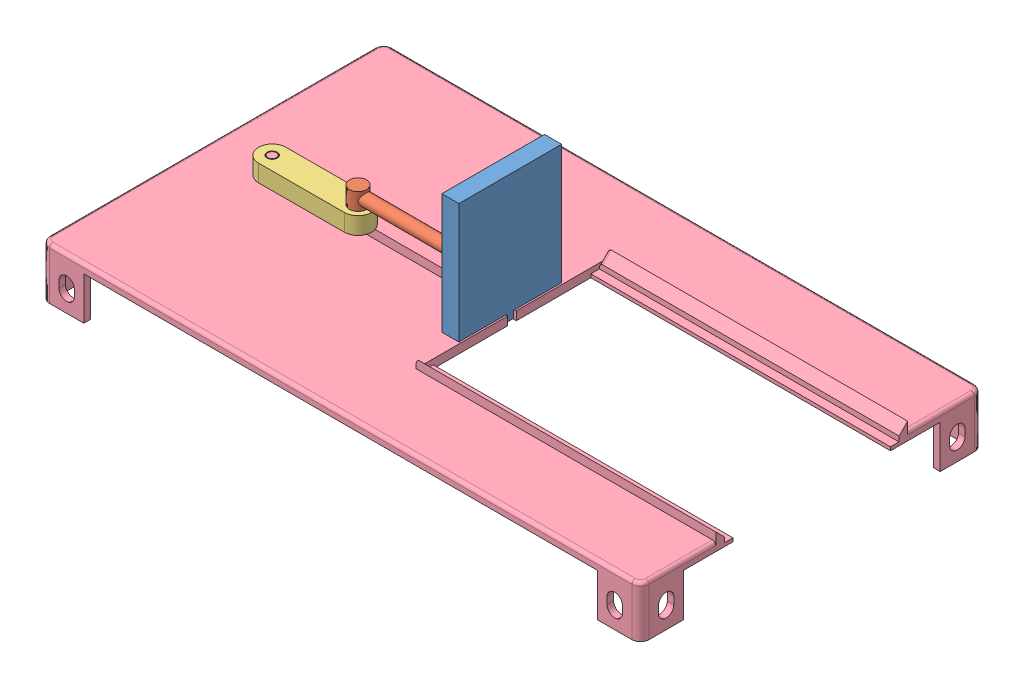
SolidWorks assembly Ensamblaje1.sldasm, configuration Predeterminado (file format 14000). Lengths in mm.
Overall size (350 100 200).
4 component instances, 4 part files, 7 mates.
Components (placement in the parent):
- Piezaempuje-1: Piezaempuje.SLDPRT [Predeterminado] at (-24.2595 -39.6156 219.0668) size (30 74 60)
- Viela-1: Viela.SLDPRT [Predeterminado] at (-103.2594 -59.6156 218.9727) x (0.999999 0 0.001447) z (-0.001447 0 0.999999) size (75 18 10)
- Manivela-1: Manivela.SLDPRT [Predeterminado] at (-153.2594 -74.6156 219.0668) x (0.999998 0 -0.001882) z (0.001882 0 0.999998) size (66 10 16)
- BasePlataforma-1: BasePlataforma.SLDPRT [Predeterminado] at (-13.2594 -79.6156 219.0668) size (350 40 200)
Mates (geometry in assembly coordinates):
- Concéntrica1: concentric anti-aligned: cylinder of Viela-1 through (-103.2594 -72.6156 218.9727) axis (0 1 0) radius 3; cylinder of Manivela-1 through (-103.2594 -64.6156 218.9727) axis (0 -1 0) radius 3.5
- Coincidente1: coincident anti-aligned: plane of Viela-1 through (-103.2594 -64.6156 218.9727) normal (0 -1 0); plane of Manivela-1 through (-153.2594 -64.6156 219.0668) normal (0 1 0)
- Concéntrica2: concentric aligned: cylinder of Piezaempuje-1 through (-38.2595 -94.6156 219.0668) axis (0 1 0) radius 3.5; cylinder of Viela-1 through (-38.2595 -72.6156 219.0668) axis (0 1 0) radius 3
- Coincidente2: coincident anti-aligned: plane of Piezaempuje-1 through (-44.2595 -64.6156 211.5668) normal (0 1 0); plane of Viela-1 through (-38.2595 -64.6156 219.0668) normal (0 -1 0)
- Concéntrica3: concentric aligned: cylinder of Manivela-1 through (-153.2594 -64.6156 219.0668) axis (0 -1 0) radius 3; cylinder of BasePlataforma-1 through (-153.2594 -64.6156 219.0668) axis (0 -1 0) radius 2.5
- Coincidente3: coincident anti-aligned: plane of Manivela-1 through (-153.2594 -74.6156 219.0668) normal (0 -1 0); plane of BasePlataforma-1 through (-13.2594 -74.6156 219.0668) normal (0 1 0)
- Distancia1: distance = 0.5 mm anti-aligned: plane of Piezaempuje-1 through (-24.2595 -78.6156 217.0668) normal (0 0 -1); plane of BasePlataforma-1 through (-13.2594 -84.6156 216.5668) normal (0 0 1)
